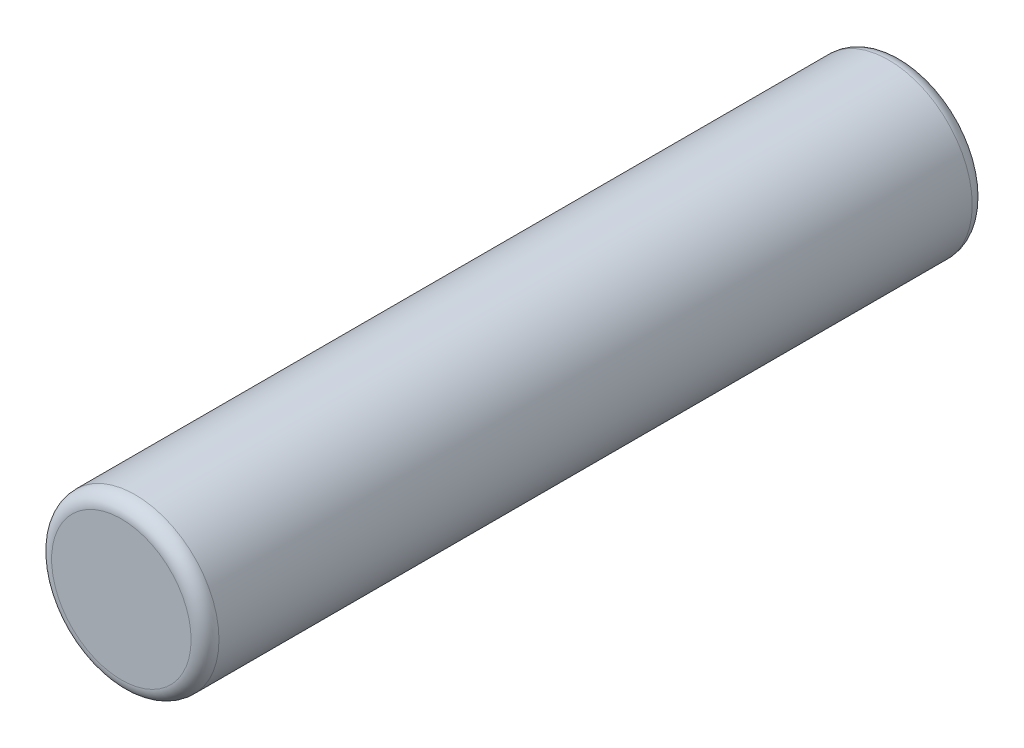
ISO-10303-21;
HEADER;
FILE_DESCRIPTION(('STEP AP214'),'2;1');
FILE_NAME('part.step','',(''),(''),'','','');
FILE_SCHEMA(('AUTOMOTIVE_DESIGN { 1 0 10303 214 1 1 1 1 }'));
ENDSEC;
DATA;
#1=APPLICATION_CONTEXT('core data for automotive mechanical design processes');
#2=APPLICATION_PROTOCOL_DEFINITION('international standard','automotive_design',2000,#1);
#3=PRODUCT_CONTEXT('',#1,'mechanical');
#4=PRODUCT('Part','Part','',(#3));
#5=PRODUCT_RELATED_PRODUCT_CATEGORY('part','',(#4));
#6=PRODUCT_DEFINITION_FORMATION('','',#4);
#7=PRODUCT_DEFINITION_CONTEXT('part definition',#1,'design');
#8=PRODUCT_DEFINITION('design','',#6,#7);
#9=PRODUCT_DEFINITION_SHAPE('','',#8);
#10=(LENGTH_UNIT() NAMED_UNIT(*) SI_UNIT(.MILLI.,.METRE.));
#11=(NAMED_UNIT(*) PLANE_ANGLE_UNIT() SI_UNIT($,.RADIAN.));
#12=(NAMED_UNIT(*) SI_UNIT($,.STERADIAN.) SOLID_ANGLE_UNIT());
#13=UNCERTAINTY_MEASURE_WITH_UNIT(LENGTH_MEASURE(1.E-05),#10,'distance_accuracy_value','');
#14=(GEOMETRIC_REPRESENTATION_CONTEXT(3) GLOBAL_UNCERTAINTY_ASSIGNED_CONTEXT((#13)) GLOBAL_UNIT_ASSIGNED_CONTEXT((#10,
#11,#12)) REPRESENTATION_CONTEXT('',''));
#15=CARTESIAN_POINT('',(0.,0.,0.));
#16=DIRECTION('',(0.,0.,1.));
#17=DIRECTION('',(1.,0.,0.));
#18=AXIS2_PLACEMENT_3D('',#15,#16,#17);
#19=CARTESIAN_POINT('',(0.,0.,7.));
#20=DIRECTION('',(0.,0.,-1.));
#21=DIRECTION('',(-1.,0.,0.));
#22=AXIS2_PLACEMENT_3D('',#19,#20,#21);
#23=CYLINDRICAL_SURFACE('',#22,1.5);
#24=CARTESIAN_POINT('',(0.,0.,-6.75));
#25=DIRECTION('',(0.,0.,1.));
#26=DIRECTION('',(1.,0.,0.));
#27=AXIS2_PLACEMENT_3D('',#24,#25,#26);
#28=CIRCLE('',#27,1.5);
#29=CARTESIAN_POINT('',(1.5,0.,-6.75));
#30=VERTEX_POINT('',#29);
#31=EDGE_CURVE('E40',#30,#30,#28,.T.);
#32=ORIENTED_EDGE('',*,*,#31,.T.);
#33=EDGE_LOOP('',(#32));
#34=FACE_BOUND('',#33,.T.);
#35=CARTESIAN_POINT('',(0.,0.,6.75));
#36=DIRECTION('',(0.,0.,1.));
#37=DIRECTION('',(1.,0.,0.));
#38=AXIS2_PLACEMENT_3D('',#35,#36,#37);
#39=CIRCLE('',#38,1.5);
#40=CARTESIAN_POINT('',(1.5,0.,6.75));
#41=VERTEX_POINT('',#40);
#42=EDGE_CURVE('E44',#41,#41,#39,.F.);
#43=ORIENTED_EDGE('',*,*,#42,.T.);
#44=EDGE_LOOP('',(#43));
#45=FACE_BOUND('',#44,.T.);
#46=ADVANCED_FACE('F29',(#34,#45),#23,.T.);
#47=CARTESIAN_POINT('',(0.,0.,7.));
#48=DIRECTION('',(0.,0.,1.));
#49=DIRECTION('',(1.,0.,0.));
#50=AXIS2_PLACEMENT_3D('',#47,#48,#49);
#51=PLANE('',#50);
#52=CARTESIAN_POINT('',(0.,0.,7.));
#53=DIRECTION('',(0.,0.,1.));
#54=DIRECTION('',(1.,0.,0.));
#55=AXIS2_PLACEMENT_3D('',#52,#53,#54);
#56=CIRCLE('',#55,1.25);
#57=CARTESIAN_POINT('',(1.25,0.,7.));
#58=VERTEX_POINT('',#57);
#59=EDGE_CURVE('E10',#58,#58,#56,.T.);
#60=ORIENTED_EDGE('',*,*,#59,.T.);
#61=EDGE_LOOP('',(#60));
#62=FACE_BOUND('',#61,.T.);
#63=ADVANCED_FACE('F60',(#62),#51,.T.);
#64=CARTESIAN_POINT('',(0.,0.,-7.));
#65=DIRECTION('',(0.,0.,1.));
#66=DIRECTION('',(1.,0.,0.));
#67=AXIS2_PLACEMENT_3D('',#64,#65,#66);
#68=PLANE('',#67);
#69=CARTESIAN_POINT('',(0.,0.,-7.));
#70=DIRECTION('',(0.,0.,1.));
#71=DIRECTION('',(1.,0.,0.));
#72=AXIS2_PLACEMENT_3D('',#69,#70,#71);
#73=CIRCLE('',#72,1.25);
#74=CARTESIAN_POINT('',(1.25,0.,-7.));
#75=VERTEX_POINT('',#74);
#76=EDGE_CURVE('E36',#75,#75,#73,.F.);
#77=ORIENTED_EDGE('',*,*,#76,.T.);
#78=EDGE_LOOP('',(#77));
#79=FACE_BOUND('',#78,.T.);
#80=ADVANCED_FACE('F57',(#79),#68,.F.);
#81=CARTESIAN_POINT('',(0.,0.,-6.75));
#82=DIRECTION('',(0.,0.,1.));
#83=DIRECTION('',(1.,0.,0.));
#84=AXIS2_PLACEMENT_3D('',#81,#82,#83);
#85=TOROIDAL_SURFACE('',#84,1.25,0.25);
#86=ORIENTED_EDGE('',*,*,#76,.F.);
#87=EDGE_LOOP('',(#86));
#88=FACE_BOUND('',#87,.T.);
#89=ORIENTED_EDGE('',*,*,#31,.F.);
#90=EDGE_LOOP('',(#89));
#91=FACE_BOUND('',#90,.T.);
#92=ADVANCED_FACE('F53',(#88,#91),#85,.T.);
#93=CARTESIAN_POINT('',(0.,0.,6.75));
#94=DIRECTION('',(0.,0.,1.));
#95=DIRECTION('',(1.,0.,0.));
#96=AXIS2_PLACEMENT_3D('',#93,#94,#95);
#97=TOROIDAL_SURFACE('',#96,1.25,0.25);
#98=ORIENTED_EDGE('',*,*,#42,.F.);
#99=EDGE_LOOP('',(#98));
#100=FACE_BOUND('',#99,.T.);
#101=ORIENTED_EDGE('',*,*,#59,.F.);
#102=EDGE_LOOP('',(#101));
#103=FACE_BOUND('',#102,.T.);
#104=ADVANCED_FACE('F31',(#100,#103),#97,.T.);
#105=CLOSED_SHELL('',(#46,#63,#80,#92,#104));
#106=MANIFOLD_SOLID_BREP('B2',#105);
#107=ADVANCED_BREP_SHAPE_REPRESENTATION('',(#18,#106),#14);
#108=SHAPE_DEFINITION_REPRESENTATION(#9,#107);
ENDSEC;
END-ISO-10303-21;
